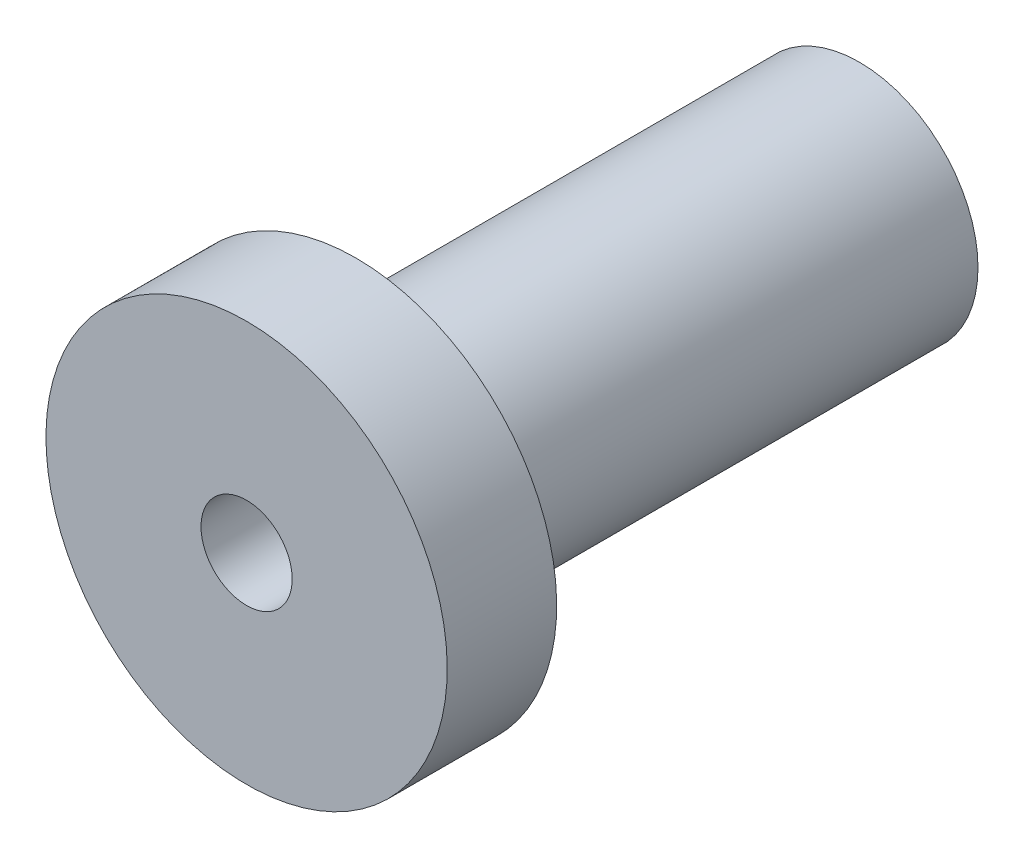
ISO-10303-21;
HEADER;
FILE_DESCRIPTION(('STEP AP214'),'2;1');
FILE_NAME('part.step','',(''),(''),'','','');
FILE_SCHEMA(('AUTOMOTIVE_DESIGN { 1 0 10303 214 1 1 1 1 }'));
ENDSEC;
DATA;
#1=APPLICATION_CONTEXT('core data for automotive mechanical design processes');
#2=APPLICATION_PROTOCOL_DEFINITION('international standard','automotive_design',2000,#1);
#3=PRODUCT_CONTEXT('',#1,'mechanical');
#4=PRODUCT('Part','Part','',(#3));
#5=PRODUCT_RELATED_PRODUCT_CATEGORY('part','',(#4));
#6=PRODUCT_DEFINITION_FORMATION('','',#4);
#7=PRODUCT_DEFINITION_CONTEXT('part definition',#1,'design');
#8=PRODUCT_DEFINITION('design','',#6,#7);
#9=PRODUCT_DEFINITION_SHAPE('','',#8);
#10=(LENGTH_UNIT() NAMED_UNIT(*) SI_UNIT(.MILLI.,.METRE.));
#11=(NAMED_UNIT(*) PLANE_ANGLE_UNIT() SI_UNIT($,.RADIAN.));
#12=(NAMED_UNIT(*) SI_UNIT($,.STERADIAN.) SOLID_ANGLE_UNIT());
#13=UNCERTAINTY_MEASURE_WITH_UNIT(LENGTH_MEASURE(1.E-05),#10,'distance_accuracy_value','');
#14=(GEOMETRIC_REPRESENTATION_CONTEXT(3) GLOBAL_UNCERTAINTY_ASSIGNED_CONTEXT((#13)) GLOBAL_UNIT_ASSIGNED_CONTEXT((#10,
#11,#12)) REPRESENTATION_CONTEXT('',''));
#15=CARTESIAN_POINT('',(0.,0.,0.));
#16=DIRECTION('',(0.,0.,1.));
#17=DIRECTION('',(1.,0.,0.));
#18=AXIS2_PLACEMENT_3D('',#15,#16,#17);
#19=CARTESIAN_POINT('',(0.,0.,-27.6));
#20=DIRECTION('',(0.,0.,-1.));
#21=DIRECTION('',(0.,1.,0.));
#22=AXIS2_PLACEMENT_3D('',#19,#20,#21);
#23=PLANE('',#22);
#24=CARTESIAN_POINT('',(0.,0.,-27.6));
#25=DIRECTION('',(0.,0.,-1.));
#26=DIRECTION('',(0.,1.,0.));
#27=AXIS2_PLACEMENT_3D('',#24,#25,#26);
#28=CIRCLE('',#27,6.5);
#29=CARTESIAN_POINT('',(0.,6.5,-27.6));
#30=VERTEX_POINT('',#29);
#31=EDGE_CURVE('E15',#30,#30,#28,.F.);
#32=ORIENTED_EDGE('',*,*,#31,.F.);
#33=EDGE_LOOP('',(#32));
#34=FACE_BOUND('',#33,.T.);
#35=ADVANCED_FACE('F12',(#34),#23,.T.);
#36=CARTESIAN_POINT('',(0.,0.,-27.6));
#37=DIRECTION('',(0.,0.,-1.));
#38=DIRECTION('',(0.,1.,0.));
#39=AXIS2_PLACEMENT_3D('',#36,#37,#38);
#40=CYLINDRICAL_SURFACE('',#39,6.5);
#41=ORIENTED_EDGE('',*,*,#31,.T.);
#42=EDGE_LOOP('',(#41));
#43=FACE_BOUND('',#42,.T.);
#44=CARTESIAN_POINT('',(0.,0.,0.));
#45=DIRECTION('',(0.,0.,-1.));
#46=DIRECTION('',(0.,1.,0.));
#47=AXIS2_PLACEMENT_3D('',#44,#45,#46);
#48=CIRCLE('',#47,6.5);
#49=CARTESIAN_POINT('',(0.,6.5,0.));
#50=VERTEX_POINT('',#49);
#51=EDGE_CURVE('E31',#50,#50,#48,.F.);
#52=ORIENTED_EDGE('',*,*,#51,.F.);
#53=EDGE_LOOP('',(#52));
#54=FACE_BOUND('',#53,.T.);
#55=ADVANCED_FACE('F38',(#43,#54),#40,.T.);
#56=CARTESIAN_POINT('',(6.5,0.,0.));
#57=DIRECTION('',(0.,0.,-1.));
#58=DIRECTION('',(0.,1.,0.));
#59=AXIS2_PLACEMENT_3D('',#56,#57,#58);
#60=PLANE('',#59);
#61=ORIENTED_EDGE('',*,*,#51,.T.);
#62=EDGE_LOOP('',(#61));
#63=FACE_BOUND('',#62,.T.);
#64=CARTESIAN_POINT('',(0.,0.,0.));
#65=DIRECTION('',(0.,0.,-1.));
#66=DIRECTION('',(0.,1.,0.));
#67=AXIS2_PLACEMENT_3D('',#64,#65,#66);
#68=CIRCLE('',#67,11.);
#69=CARTESIAN_POINT('',(0.,11.,0.));
#70=VERTEX_POINT('',#69);
#71=EDGE_CURVE('E29',#70,#70,#68,.F.);
#72=ORIENTED_EDGE('',*,*,#71,.F.);
#73=EDGE_LOOP('',(#72));
#74=FACE_BOUND('',#73,.T.);
#75=ADVANCED_FACE('F47',(#63,#74),#60,.T.);
#76=CARTESIAN_POINT('',(0.,0.,0.));
#77=DIRECTION('',(0.,0.,-1.));
#78=DIRECTION('',(0.,1.,0.));
#79=AXIS2_PLACEMENT_3D('',#76,#77,#78);
#80=CYLINDRICAL_SURFACE('',#79,11.);
#81=ORIENTED_EDGE('',*,*,#71,.T.);
#82=EDGE_LOOP('',(#81));
#83=FACE_BOUND('',#82,.T.);
#84=CARTESIAN_POINT('',(0.,0.,6.));
#85=DIRECTION('',(0.,0.,-1.));
#86=DIRECTION('',(0.,1.,0.));
#87=AXIS2_PLACEMENT_3D('',#84,#85,#86);
#88=CIRCLE('',#87,11.);
#89=CARTESIAN_POINT('',(0.,11.,6.));
#90=VERTEX_POINT('',#89);
#91=EDGE_CURVE('E24',#90,#90,#88,.F.);
#92=ORIENTED_EDGE('',*,*,#91,.F.);
#93=EDGE_LOOP('',(#92));
#94=FACE_BOUND('',#93,.T.);
#95=ADVANCED_FACE('F63',(#83,#94),#80,.T.);
#96=CARTESIAN_POINT('',(0.,0.,-16.5));
#97=DIRECTION('',(0.,0.,1.));
#98=DIRECTION('',(0.,-1.,0.));
#99=AXIS2_PLACEMENT_3D('',#96,#97,#98);
#100=PLANE('',#99);
#101=CARTESIAN_POINT('',(0.,0.,-16.5));
#102=DIRECTION('',(0.,0.,1.));
#103=DIRECTION('',(0.,-1.,0.));
#104=AXIS2_PLACEMENT_3D('',#101,#102,#103);
#105=CIRCLE('',#104,2.5);
#106=CARTESIAN_POINT('',(0.,-2.5,-16.5));
#107=VERTEX_POINT('',#106);
#108=EDGE_CURVE('E19',#107,#107,#105,.F.);
#109=ORIENTED_EDGE('',*,*,#108,.F.);
#110=EDGE_LOOP('',(#109));
#111=FACE_BOUND('',#110,.T.);
#112=ADVANCED_FACE('F56',(#111),#100,.T.);
#113=CARTESIAN_POINT('',(11.,0.,6.));
#114=DIRECTION('',(0.,0.,1.));
#115=DIRECTION('',(0.,-1.,0.));
#116=AXIS2_PLACEMENT_3D('',#113,#114,#115);
#117=PLANE('',#116);
#118=CARTESIAN_POINT('',(0.,0.,6.));
#119=DIRECTION('',(0.,0.,1.));
#120=DIRECTION('',(0.,-1.,0.));
#121=AXIS2_PLACEMENT_3D('',#118,#119,#120);
#122=CIRCLE('',#121,2.5);
#123=CARTESIAN_POINT('',(0.,-2.5,6.));
#124=VERTEX_POINT('',#123);
#125=EDGE_CURVE('E8',#124,#124,#122,.T.);
#126=ORIENTED_EDGE('',*,*,#125,.F.);
#127=EDGE_LOOP('',(#126));
#128=FACE_BOUND('',#127,.T.);
#129=ORIENTED_EDGE('',*,*,#91,.T.);
#130=EDGE_LOOP('',(#129));
#131=FACE_BOUND('',#130,.T.);
#132=ADVANCED_FACE('F50',(#128,#131),#117,.T.);
#133=CARTESIAN_POINT('',(0.,0.,-16.5));
#134=DIRECTION('',(0.,0.,1.));
#135=DIRECTION('',(0.,-1.,0.));
#136=AXIS2_PLACEMENT_3D('',#133,#134,#135);
#137=CYLINDRICAL_SURFACE('',#136,2.5);
#138=ORIENTED_EDGE('',*,*,#125,.T.);
#139=EDGE_LOOP('',(#138));
#140=FACE_BOUND('',#139,.T.);
#141=ORIENTED_EDGE('',*,*,#108,.T.);
#142=EDGE_LOOP('',(#141));
#143=FACE_BOUND('',#142,.T.);
#144=ADVANCED_FACE('F48',(#140,#143),#137,.F.);
#145=CLOSED_SHELL('',(#35,#55,#75,#95,#112,#132,#144));
#146=MANIFOLD_SOLID_BREP('B1',#145);
#147=ADVANCED_BREP_SHAPE_REPRESENTATION('',(#18,#146),#14);
#148=SHAPE_DEFINITION_REPRESENTATION(#9,#147);
ENDSEC;
END-ISO-10303-21;
